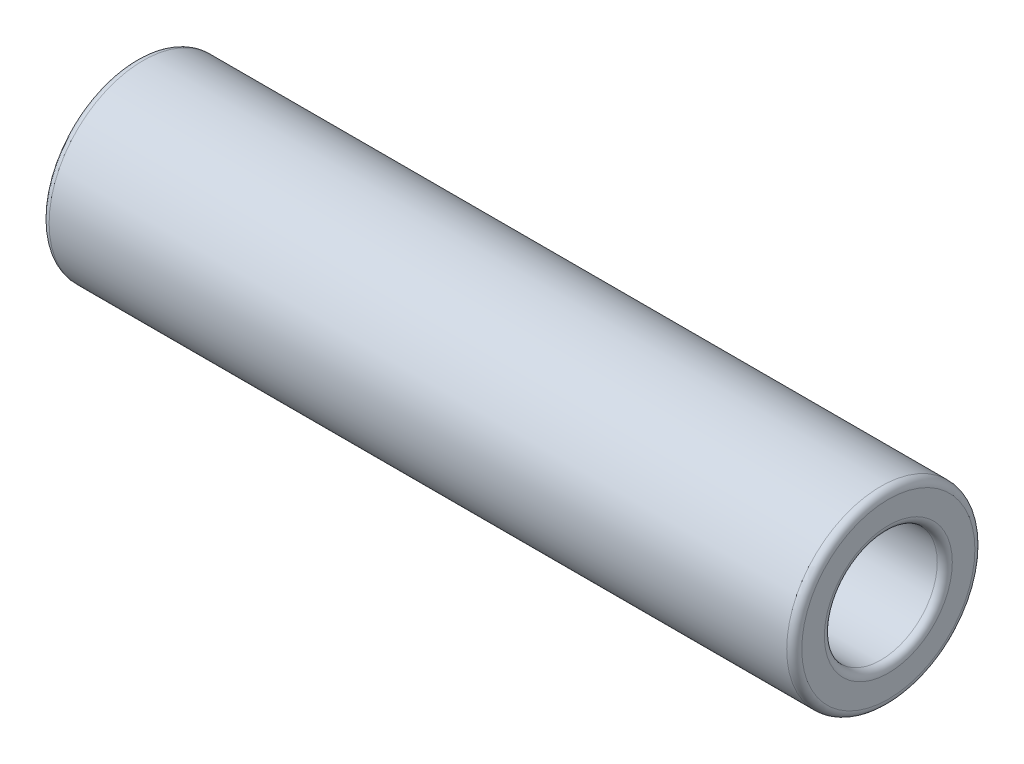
ISO-10303-21;
HEADER;
FILE_DESCRIPTION(('STEP AP214'),'2;1');
FILE_NAME('part.step','',(''),(''),'','','');
FILE_SCHEMA(('AUTOMOTIVE_DESIGN { 1 0 10303 214 1 1 1 1 }'));
ENDSEC;
DATA;
#1=APPLICATION_CONTEXT('core data for automotive mechanical design processes');
#2=APPLICATION_PROTOCOL_DEFINITION('international standard','automotive_design',2000,#1);
#3=PRODUCT_CONTEXT('',#1,'mechanical');
#4=PRODUCT('Part','Part','',(#3));
#5=PRODUCT_RELATED_PRODUCT_CATEGORY('part','',(#4));
#6=PRODUCT_DEFINITION_FORMATION('','',#4);
#7=PRODUCT_DEFINITION_CONTEXT('part definition',#1,'design');
#8=PRODUCT_DEFINITION('design','',#6,#7);
#9=PRODUCT_DEFINITION_SHAPE('','',#8);
#10=(LENGTH_UNIT() NAMED_UNIT(*) SI_UNIT(.MILLI.,.METRE.));
#11=(NAMED_UNIT(*) PLANE_ANGLE_UNIT() SI_UNIT($,.RADIAN.));
#12=(NAMED_UNIT(*) SI_UNIT($,.STERADIAN.) SOLID_ANGLE_UNIT());
#13=UNCERTAINTY_MEASURE_WITH_UNIT(LENGTH_MEASURE(1.E-05),#10,'distance_accuracy_value','');
#14=(GEOMETRIC_REPRESENTATION_CONTEXT(3) GLOBAL_UNCERTAINTY_ASSIGNED_CONTEXT((#13)) GLOBAL_UNIT_ASSIGNED_CONTEXT((#10,
#11,#12)) REPRESENTATION_CONTEXT('',''));
#15=CARTESIAN_POINT('',(0.,0.,0.));
#16=DIRECTION('',(0.,0.,1.));
#17=DIRECTION('',(1.,0.,0.));
#18=AXIS2_PLACEMENT_3D('',#15,#16,#17);
#19=CARTESIAN_POINT('',(50.,0.,0.));
#20=DIRECTION('',(1.,0.,0.));
#21=DIRECTION('',(0.,0.,-1.));
#22=AXIS2_PLACEMENT_3D('',#19,#20,#21);
#23=PLANE('',#22);
#24=CARTESIAN_POINT('',(50.,0.,0.));
#25=DIRECTION('',(1.,0.,0.));
#26=DIRECTION('',(0.,0.,-1.));
#27=AXIS2_PLACEMENT_3D('',#24,#25,#26);
#28=CIRCLE('',#27,4.25);
#29=CARTESIAN_POINT('',(50.,0.,-4.25));
#30=VERTEX_POINT('',#29);
#31=EDGE_CURVE('E10',#30,#30,#28,.F.);
#32=ORIENTED_EDGE('',*,*,#31,.T.);
#33=EDGE_LOOP('',(#32));
#34=FACE_BOUND('',#33,.T.);
#35=CARTESIAN_POINT('',(50.,0.,0.));
#36=DIRECTION('',(1.,0.,0.));
#37=DIRECTION('',(0.,0.,-1.));
#38=AXIS2_PLACEMENT_3D('',#35,#36,#37);
#39=CIRCLE('',#38,5.75);
#40=CARTESIAN_POINT('',(50.,0.,-5.75));
#41=VERTEX_POINT('',#40);
#42=EDGE_CURVE('E37',#41,#41,#39,.T.);
#43=ORIENTED_EDGE('',*,*,#42,.T.);
#44=EDGE_LOOP('',(#43));
#45=FACE_BOUND('',#44,.T.);
#46=ADVANCED_FACE('F30',(#34,#45),#23,.T.);
#47=CARTESIAN_POINT('',(0.,0.,0.));
#48=DIRECTION('',(1.,0.,0.));
#49=DIRECTION('',(0.,0.,-1.));
#50=AXIS2_PLACEMENT_3D('',#47,#48,#49);
#51=PLANE('',#50);
#52=CARTESIAN_POINT('',(0.,0.,0.));
#53=DIRECTION('',(1.,0.,0.));
#54=DIRECTION('',(0.,0.,-1.));
#55=AXIS2_PLACEMENT_3D('',#52,#53,#54);
#56=CIRCLE('',#55,4.25);
#57=CARTESIAN_POINT('',(0.,0.,-4.25));
#58=VERTEX_POINT('',#57);
#59=EDGE_CURVE('E56',#58,#58,#56,.T.);
#60=ORIENTED_EDGE('',*,*,#59,.T.);
#61=EDGE_LOOP('',(#60));
#62=FACE_BOUND('',#61,.T.);
#63=CARTESIAN_POINT('',(0.,0.,0.));
#64=DIRECTION('',(1.,0.,0.));
#65=DIRECTION('',(0.,0.,-1.));
#66=AXIS2_PLACEMENT_3D('',#63,#64,#65);
#67=CIRCLE('',#66,5.75);
#68=CARTESIAN_POINT('',(0.,0.,-5.75));
#69=VERTEX_POINT('',#68);
#70=EDGE_CURVE('E59',#69,#69,#67,.F.);
#71=ORIENTED_EDGE('',*,*,#70,.T.);
#72=EDGE_LOOP('',(#71));
#73=FACE_BOUND('',#72,.T.);
#74=ADVANCED_FACE('F63',(#62,#73),#51,.F.);
#75=CARTESIAN_POINT('',(50.,0.,0.));
#76=DIRECTION('',(-1.,0.,0.));
#77=DIRECTION('',(0.,0.,1.));
#78=AXIS2_PLACEMENT_3D('',#75,#76,#77);
#79=CYLINDRICAL_SURFACE('',#78,6.25);
#80=CARTESIAN_POINT('',(0.5,0.,0.));
#81=DIRECTION('',(1.,0.,0.));
#82=DIRECTION('',(0.,0.,-1.));
#83=AXIS2_PLACEMENT_3D('',#80,#81,#82);
#84=CIRCLE('',#83,6.25);
#85=CARTESIAN_POINT('',(0.5,0.,-6.25));
#86=VERTEX_POINT('',#85);
#87=EDGE_CURVE('E41',#86,#86,#84,.T.);
#88=ORIENTED_EDGE('',*,*,#87,.T.);
#89=EDGE_LOOP('',(#88));
#90=FACE_BOUND('',#89,.T.);
#91=CARTESIAN_POINT('',(49.5,0.,0.));
#92=DIRECTION('',(1.,0.,0.));
#93=DIRECTION('',(0.,0.,-1.));
#94=AXIS2_PLACEMENT_3D('',#91,#92,#93);
#95=CIRCLE('',#94,6.25);
#96=CARTESIAN_POINT('',(49.5,0.,-6.25));
#97=VERTEX_POINT('',#96);
#98=EDGE_CURVE('E45',#97,#97,#95,.F.);
#99=ORIENTED_EDGE('',*,*,#98,.T.);
#100=EDGE_LOOP('',(#99));
#101=FACE_BOUND('',#100,.T.);
#102=ADVANCED_FACE('F73',(#90,#101),#79,.T.);
#103=CARTESIAN_POINT('',(50.,0.,0.));
#104=DIRECTION('',(-1.,0.,0.));
#105=DIRECTION('',(0.,0.,1.));
#106=AXIS2_PLACEMENT_3D('',#103,#104,#105);
#107=CYLINDRICAL_SURFACE('',#106,3.75);
#108=CARTESIAN_POINT('',(0.5,0.,0.));
#109=DIRECTION('',(1.,0.,0.));
#110=DIRECTION('',(0.,0.,-1.));
#111=AXIS2_PLACEMENT_3D('',#108,#109,#110);
#112=CIRCLE('',#111,3.75);
#113=CARTESIAN_POINT('',(0.5,0.,-3.75));
#114=VERTEX_POINT('',#113);
#115=EDGE_CURVE('E50',#114,#114,#112,.F.);
#116=ORIENTED_EDGE('',*,*,#115,.T.);
#117=EDGE_LOOP('',(#116));
#118=FACE_BOUND('',#117,.T.);
#119=CARTESIAN_POINT('',(49.5,0.,0.));
#120=DIRECTION('',(1.,0.,0.));
#121=DIRECTION('',(0.,0.,-1.));
#122=AXIS2_PLACEMENT_3D('',#119,#120,#121);
#123=CIRCLE('',#122,3.75);
#124=CARTESIAN_POINT('',(49.5,0.,-3.75));
#125=VERTEX_POINT('',#124);
#126=EDGE_CURVE('E53',#125,#125,#123,.T.);
#127=ORIENTED_EDGE('',*,*,#126,.T.);
#128=EDGE_LOOP('',(#127));
#129=FACE_BOUND('',#128,.T.);
#130=ADVANCED_FACE('F76',(#118,#129),#107,.F.);
#131=CARTESIAN_POINT('',(0.5,0.,0.));
#132=DIRECTION('',(1.,0.,0.));
#133=DIRECTION('',(0.,0.,-1.));
#134=AXIS2_PLACEMENT_3D('',#131,#132,#133);
#135=TOROIDAL_SURFACE('',#134,4.25,0.5);
#136=ORIENTED_EDGE('',*,*,#115,.F.);
#137=EDGE_LOOP('',(#136));
#138=FACE_BOUND('',#137,.T.);
#139=ORIENTED_EDGE('',*,*,#59,.F.);
#140=EDGE_LOOP('',(#139));
#141=FACE_BOUND('',#140,.T.);
#142=ADVANCED_FACE('F69',(#138,#141),#135,.T.);
#143=CARTESIAN_POINT('',(0.5,0.,0.));
#144=DIRECTION('',(1.,0.,0.));
#145=DIRECTION('',(0.,0.,-1.));
#146=AXIS2_PLACEMENT_3D('',#143,#144,#145);
#147=TOROIDAL_SURFACE('',#146,5.75,0.5);
#148=ORIENTED_EDGE('',*,*,#70,.F.);
#149=EDGE_LOOP('',(#148));
#150=FACE_BOUND('',#149,.T.);
#151=ORIENTED_EDGE('',*,*,#87,.F.);
#152=EDGE_LOOP('',(#151));
#153=FACE_BOUND('',#152,.T.);
#154=ADVANCED_FACE('F65',(#150,#153),#147,.T.);
#155=CARTESIAN_POINT('',(49.5,0.,0.));
#156=DIRECTION('',(1.,0.,0.));
#157=DIRECTION('',(0.,0.,-1.));
#158=AXIS2_PLACEMENT_3D('',#155,#156,#157);
#159=TOROIDAL_SURFACE('',#158,4.25,0.5);
#160=ORIENTED_EDGE('',*,*,#31,.F.);
#161=EDGE_LOOP('',(#160));
#162=FACE_BOUND('',#161,.T.);
#163=ORIENTED_EDGE('',*,*,#126,.F.);
#164=EDGE_LOOP('',(#163));
#165=FACE_BOUND('',#164,.T.);
#166=ADVANCED_FACE('F68',(#162,#165),#159,.T.);
#167=CARTESIAN_POINT('',(49.5,0.,0.));
#168=DIRECTION('',(1.,0.,0.));
#169=DIRECTION('',(0.,0.,-1.));
#170=AXIS2_PLACEMENT_3D('',#167,#168,#169);
#171=TOROIDAL_SURFACE('',#170,5.75,0.5);
#172=ORIENTED_EDGE('',*,*,#98,.F.);
#173=EDGE_LOOP('',(#172));
#174=FACE_BOUND('',#173,.T.);
#175=ORIENTED_EDGE('',*,*,#42,.F.);
#176=EDGE_LOOP('',(#175));
#177=FACE_BOUND('',#176,.T.);
#178=ADVANCED_FACE('F32',(#174,#177),#171,.T.);
#179=CLOSED_SHELL('',(#46,#74,#102,#130,#142,#154,#166,#178));
#180=MANIFOLD_SOLID_BREP('B2',#179);
#181=ADVANCED_BREP_SHAPE_REPRESENTATION('',(#18,#180),#14);
#182=SHAPE_DEFINITION_REPRESENTATION(#9,#181);
ENDSEC;
END-ISO-10303-21;
